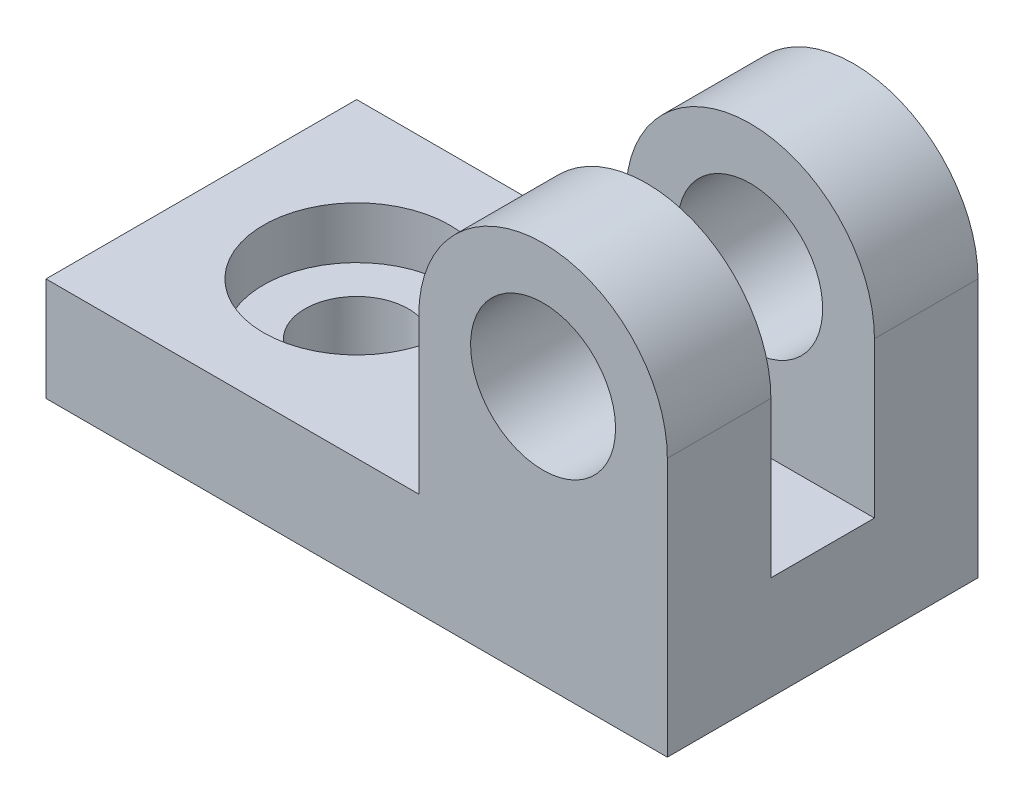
from build123d import *

# Parameters (mm, degrees)
SKETCH_1_W          = 60
SKETCH_1_H          = 10
EXTRUDE_1_DEPTH     = 15
SKETCH_2_R          = 5
CUT_EXTRUDE_2_DEPTH = 15
SKETCH_3_R          = 9
CUT_EXTRUDE_3_DEPTH = 5
SKETCH_4_R          = 7
EXTRUDE_3_DEPTH     = 15
SKETCH_6_W          = 10
SKETCH_6_H          = 30.25877903
CUT_EXTRUDE_4_DEPTH = 25


with BuildPart() as part:
    # Sketch 1 → Extrude 1 (new, symmetric)
    with BuildSketch(Plane.XY):
        with Locations((-25.095588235, 0)):
            Rectangle(SKETCH_1_W, SKETCH_1_H)
    extrude(amount=EXTRUDE_1_DEPTH, both=True)

    # Sketch 2 → Cut-Extrude 2 (cut, symmetric)
    with BuildSketch(Plane(origin=(0, 0, 0), x_dir=(1, 0, 0), z_dir=(0, 1, 0))):
        with Locations(Location((-40.095588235, 0, 0), (0, 0, 180))):
            Circle(SKETCH_2_R)
    extrude(amount=CUT_EXTRUDE_2_DEPTH, both=True, mode=Mode.SUBTRACT)

    # Sketch 3 → Cut-Extrude 3 (cut)
    with BuildSketch(Plane(origin=(0, 0, 0), x_dir=(1, 0, 0), z_dir=(0, 1, 0))):
        with Locations(Location((-40.095588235, 0, 0), (0, 0, 90))):
            Circle(SKETCH_3_R)
    extrude(amount=CUT_EXTRUDE_3_DEPTH, mode=Mode.SUBTRACT)

    # Sketch 4 → Extrude 3 (add, symmetric)
    with BuildSketch(Plane.XY):
        with BuildLine():
            Line((4.904411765, 5), (4.904411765, 20))
            ThreePointArc((4.904411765, 20), (-7.095588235, 32), (-19.095588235, 20))
            Line((-19.095588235, 20), (-19.095588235, 5))
            Line((-19.095588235, 5), (4.904411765, 5))
        make_face()
        with Locations((-7.095588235, 20)):
            Circle(SKETCH_4_R, mode=Mode.SUBTRACT)
    extrude(amount=EXTRUDE_3_DEPTH, both=True)

    # Sketch 6 → Cut-Extrude 4 (cut, symmetric)
    with BuildSketch(Plane(origin=(0, 0, 0), x_dir=(0, 0, -1), z_dir=(1, 0, 0))):
        with Locations((0, 20.129389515)):
            Rectangle(SKETCH_6_W, SKETCH_6_H)
    extrude(amount=CUT_EXTRUDE_4_DEPTH, both=True, mode=Mode.SUBTRACT)


solid = part.part
